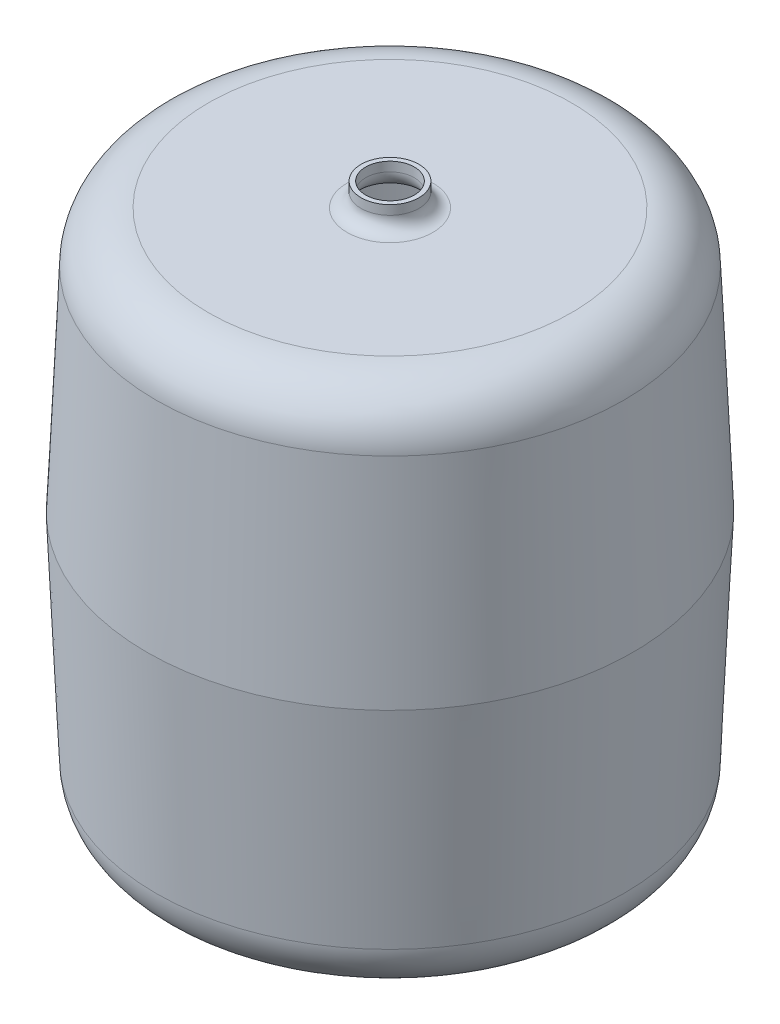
from build123d import *


with BuildPart() as part:
    # Sketch 1 → Revolve 3 (revolve)
    with BuildSketch(Plane.XY, mode=Mode.PRIVATE) as revolve_3_sk:
        with BuildLine():
            Line((0, -475), (-156.921871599, -475))
            ThreePointArc((-156.921871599, -475), (-188.039959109, -462.506378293), (-201.87904157, -431.962872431))
            Line((-201.87904157, -431.962872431), (-209.932864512, -247.5))
            Line((-209.932864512, -247.5), (-201.87904157, -63.037127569))
            ThreePointArc((-201.87904157, -63.037127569), (-188.039959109, -32.493621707), (-156.921871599, -20))
            Line((-156.921871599, -20), (-37, -20))
            ThreePointArc((-37, -20), (-28.514718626, -16.485281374), (-25, -8))
            Line((-25, -8), (-25, 0))
            Line((-25, 0), (-21, 0))
            Line((-21, 0), (-21, -4))
            Line((-21, -4), (-21, -8))
            ThreePointArc((-21, -8), (-25.686291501, -19.313708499), (-37, -24))
            Line((-37, -24), (-156.921871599, -24))
            ThreePointArc((-156.921871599, -24), (-185.273906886, -35.383077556), (-197.882848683, -63.211605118))
            Line((-197.882848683, -63.211605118), (-205.929053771, -247.5))
            Line((-205.929053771, -247.5), (-197.882848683, -431.788394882))
            ThreePointArc((-197.882848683, -431.788394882), (-185.273906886, -459.616922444), (-156.921871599, -471))
            Line((-156.921871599, -471), (0, -471))
            Line((0, -471), (0, -475))
        make_face()
    revolve(revolve_3_sk.sketch.rotate(Axis((0, -471, 0), (0, -1, 0)), 270), axis=Axis((0, -471, 0), (0, -1, 0)))


solid = part.part
